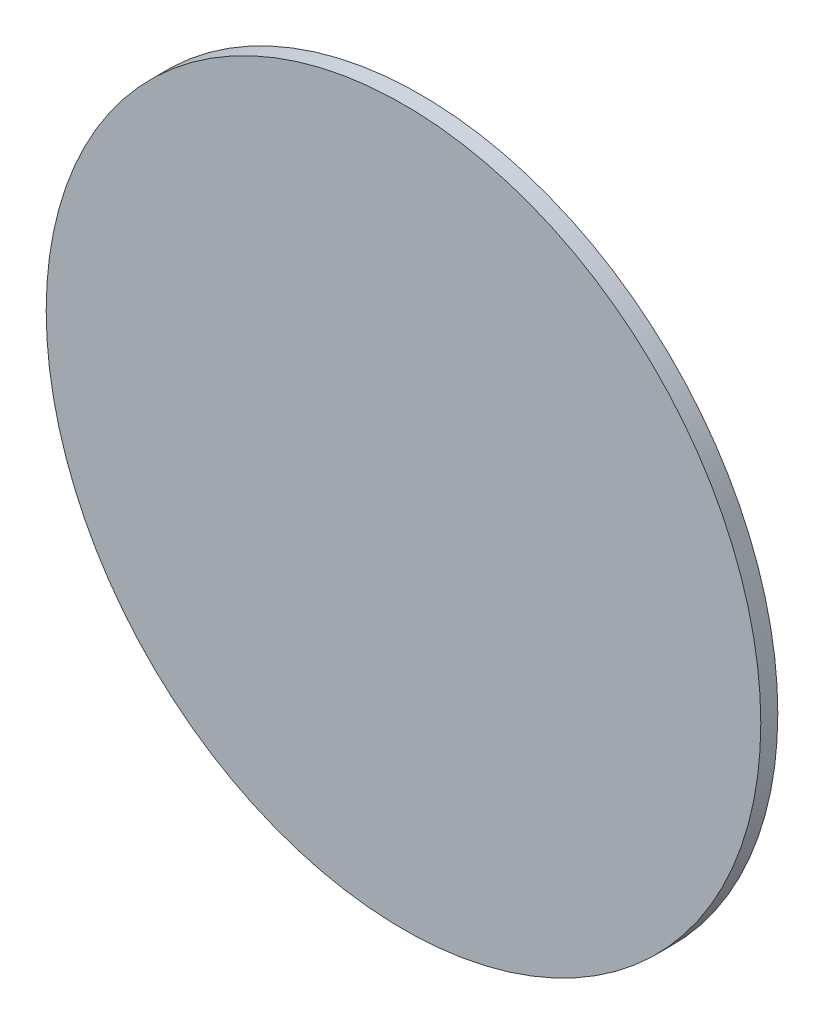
ISO-10303-21;
HEADER;
FILE_DESCRIPTION(('STEP AP214'),'2;1');
FILE_NAME('part.step','',(''),(''),'','','');
FILE_SCHEMA(('AUTOMOTIVE_DESIGN { 1 0 10303 214 1 1 1 1 }'));
ENDSEC;
DATA;
#1=APPLICATION_CONTEXT('core data for automotive mechanical design processes');
#2=APPLICATION_PROTOCOL_DEFINITION('international standard','automotive_design',2000,#1);
#3=PRODUCT_CONTEXT('',#1,'mechanical');
#4=PRODUCT('Part','Part','',(#3));
#5=PRODUCT_RELATED_PRODUCT_CATEGORY('part','',(#4));
#6=PRODUCT_DEFINITION_FORMATION('','',#4);
#7=PRODUCT_DEFINITION_CONTEXT('part definition',#1,'design');
#8=PRODUCT_DEFINITION('design','',#6,#7);
#9=PRODUCT_DEFINITION_SHAPE('','',#8);
#10=(LENGTH_UNIT() NAMED_UNIT(*) SI_UNIT(.MILLI.,.METRE.));
#11=(NAMED_UNIT(*) PLANE_ANGLE_UNIT() SI_UNIT($,.RADIAN.));
#12=(NAMED_UNIT(*) SI_UNIT($,.STERADIAN.) SOLID_ANGLE_UNIT());
#13=UNCERTAINTY_MEASURE_WITH_UNIT(LENGTH_MEASURE(1.E-05),#10,'distance_accuracy_value','');
#14=(GEOMETRIC_REPRESENTATION_CONTEXT(3) GLOBAL_UNCERTAINTY_ASSIGNED_CONTEXT((#13)) GLOBAL_UNIT_ASSIGNED_CONTEXT((#10,
#11,#12)) REPRESENTATION_CONTEXT('',''));
#15=CARTESIAN_POINT('',(0.,0.,0.));
#16=DIRECTION('',(0.,0.,1.));
#17=DIRECTION('',(1.,0.,0.));
#18=AXIS2_PLACEMENT_3D('',#15,#16,#17);
#19=CARTESIAN_POINT('',(0.,0.,1.27));
#20=DIRECTION('',(0.,0.,-1.));
#21=DIRECTION('',(-1.,0.,0.));
#22=AXIS2_PLACEMENT_3D('',#19,#20,#21);
#23=CYLINDRICAL_SURFACE('',#22,53.3466333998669);
#24=CARTESIAN_POINT('',(0.,0.,1.27));
#25=DIRECTION('',(0.,0.,1.));
#26=DIRECTION('',(1.,0.,0.));
#27=AXIS2_PLACEMENT_3D('',#24,#25,#26);
#28=CIRCLE('',#27,53.3466333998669);
#29=CARTESIAN_POINT('',(53.3466333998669,0.,1.27));
#30=VERTEX_POINT('',#29);
#31=EDGE_CURVE('E10',#30,#30,#28,.T.);
#32=ORIENTED_EDGE('',*,*,#31,.F.);
#33=EDGE_LOOP('',(#32));
#34=FACE_BOUND('',#33,.T.);
#35=CARTESIAN_POINT('',(0.,0.,-1.27));
#36=DIRECTION('',(0.,0.,1.));
#37=DIRECTION('',(1.,0.,0.));
#38=AXIS2_PLACEMENT_3D('',#35,#36,#37);
#39=CIRCLE('',#38,53.3466333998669);
#40=CARTESIAN_POINT('',(53.3466333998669,0.,-1.27));
#41=VERTEX_POINT('',#40);
#42=EDGE_CURVE('E33',#41,#41,#39,.T.);
#43=ORIENTED_EDGE('',*,*,#42,.T.);
#44=EDGE_LOOP('',(#43));
#45=FACE_BOUND('',#44,.T.);
#46=ADVANCED_FACE('F27',(#34,#45),#23,.T.);
#47=CARTESIAN_POINT('',(0.,0.,1.27));
#48=DIRECTION('',(0.,0.,1.));
#49=DIRECTION('',(1.,0.,0.));
#50=AXIS2_PLACEMENT_3D('',#47,#48,#49);
#51=PLANE('',#50);
#52=ORIENTED_EDGE('',*,*,#31,.T.);
#53=EDGE_LOOP('',(#52));
#54=FACE_BOUND('',#53,.T.);
#55=ADVANCED_FACE('F42',(#54),#51,.T.);
#56=CARTESIAN_POINT('',(0.,0.,-1.27));
#57=DIRECTION('',(0.,0.,1.));
#58=DIRECTION('',(1.,0.,0.));
#59=AXIS2_PLACEMENT_3D('',#56,#57,#58);
#60=PLANE('',#59);
#61=ORIENTED_EDGE('',*,*,#42,.F.);
#62=EDGE_LOOP('',(#61));
#63=FACE_BOUND('',#62,.T.);
#64=ADVANCED_FACE('F40',(#63),#60,.F.);
#65=CLOSED_SHELL('',(#46,#55,#64));
#66=MANIFOLD_SOLID_BREP('B2',#65);
#67=ADVANCED_BREP_SHAPE_REPRESENTATION('',(#18,#66),#14);
#68=SHAPE_DEFINITION_REPRESENTATION(#9,#67);
ENDSEC;
END-ISO-10303-21;
